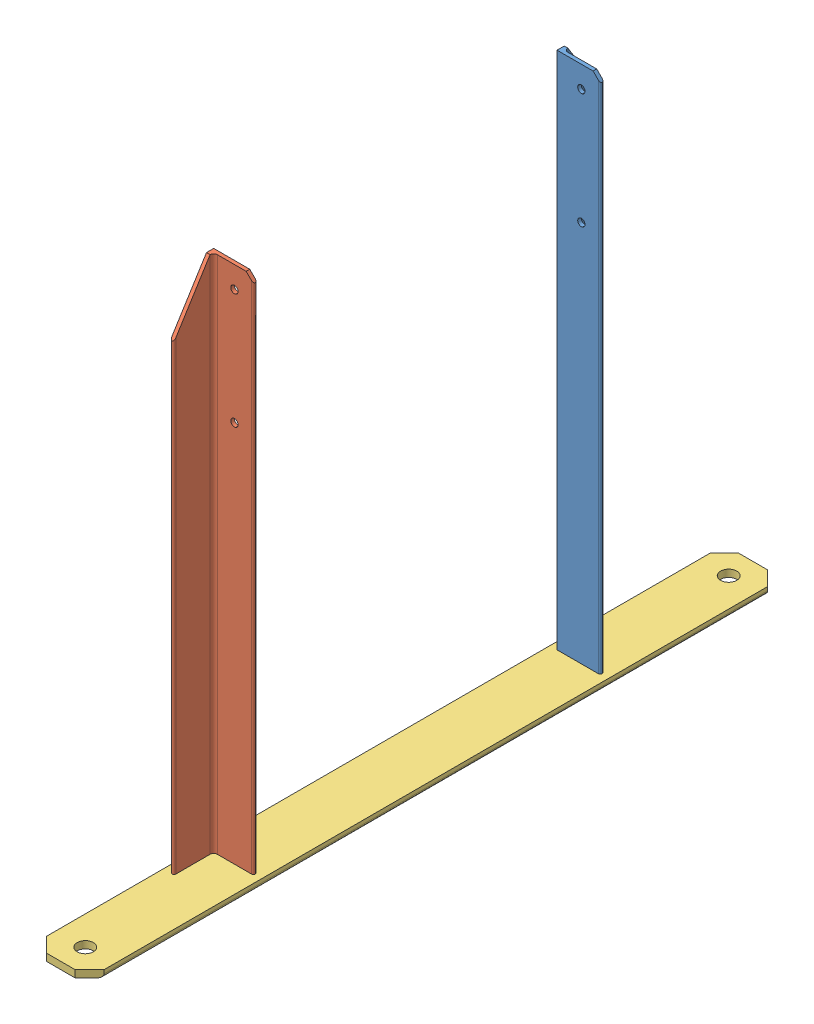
SolidWorks assembly Pecan Sanitizer Front Leg Assy.SLDASM, configuration Default (file format 9000). Lengths in mm.
Overall size (50.8 508 609.6).
3 component instances, 3 part files, 6 mates.
Components (placement in the parent):
- Pecan Sanitizer Front Leg RS SS 1.5 X 1.5 X .125 ANG-1: Pecan Sanitizer Front Leg RS SS 1.5 X 1.5 X .125 ANG.SLDPRT [Default] at (-157.0308 -116.7901 -1374.597) x (0 0 -1) z (0 -1 0) size (38.1 38.1 457.2)
- Pecan Sanitizer Front Leg LS SS 1.5 X 1.5 X .125 ANG-1: Pecan Sanitizer Front Leg LS SS 1.5 X 1.5 X .125 ANG.SLDPRT [Default] at (-157.0308 -116.7901 -1072.3522) x (0 0 1) z (0 1 0) size (38.1 38.1 457.2)
- Pecan Sanitizer Cross Brace SS  2 x 2 x .25 ANGLE-2: Pecan Sanitizer Cross Brace SS  2 x 2 x .25 ANGLE.SLDPRT [Default] at (-163.3808 -345.3901 -1223.4746) x (1 0 0) z (0 0 -1) size (50.8 50.8 609.6)
Mates (geometry in assembly coordinates):
- Coincident6: coincident aligned: plane of Pecan Sanitizer Front Leg LS SS 1.5 X 1.5 X .125 ANG-1 through (-155.4433 -345.3901 -1035.8397) normal (0 -1 0); plane of Pecan Sanitizer Front Leg RS SS 1.5 X 1.5 X .125 ANG-1 through (-155.4433 -345.3901 -1411.1095) normal (0 -1 0)
- Coincident7: coincident aligned: plane of Pecan Sanitizer Front Leg LS SS 1.5 X 1.5 X .125 ANG-1 through (-157.0308 111.8099 -1072.3522) normal (-1 0 0); plane of Pecan Sanitizer Front Leg RS SS 1.5 X 1.5 X .125 ANG-1 through (-157.0308 -345.3901 -1374.597) normal (-1 0 0)
- Distance3: distance = 302.2448 mm anti-aligned: plane of Pecan Sanitizer Front Leg LS SS 1.5 X 1.5 X .125 ANG-1 through (-157.0308 111.8099 -1072.3522) normal (0 0 -1); plane of Pecan Sanitizer Front Leg RS SS 1.5 X 1.5 X .125 ANG-1 through (-157.0308 -345.3901 -1374.597) normal (0 0 1)
- Coincident10: coincident anti-aligned: plane of Pecan Sanitizer Front Leg RS SS 1.5 X 1.5 X .125 ANG-1 through (-155.4433 -345.3901 -1411.1095) normal (0 -1 0); plane of Pecan Sanitizer Cross Brace SS  2 x 2 x .25 ANGLE-2 through (-163.3808 -345.3901 -1528.2746) normal (0 1 0)
- Distance4: distance = 6.35 mm aligned: plane of Pecan Sanitizer Cross Brace SS  2 x 2 x .25 ANGLE-2 through (-163.3808 -345.3901 -1528.2746) normal (-1 0 0); plane of Pecan Sanitizer Front Leg RS SS 1.5 X 1.5 X .125 ANG-1 through (-157.0308 -345.3901 -1374.597) normal (-1 0 0)
- Width3: width anti-aligned: plane of Pecan Sanitizer Front Leg LS SS 1.5 X 1.5 X .125 ANG-1 through (-150.6808 111.8099 -1069.1772) normal (0 0 1); plane of Pecan Sanitizer Front Leg RS SS 1.5 X 1.5 X .125 ANG-1 through (-150.6808 -345.3901 -1377.772) normal (0 0 -1); plane of Pecan Sanitizer Cross Brace SS  2 x 2 x .25 ANGLE-2 through (-115.7558 -348.5651 -1528.2746) normal (0 0 -1); plane of Pecan Sanitizer Cross Brace SS  2 x 2 x .25 ANGLE-2 through (-115.7558 -348.5651 -918.6746) normal (0 0 1)
